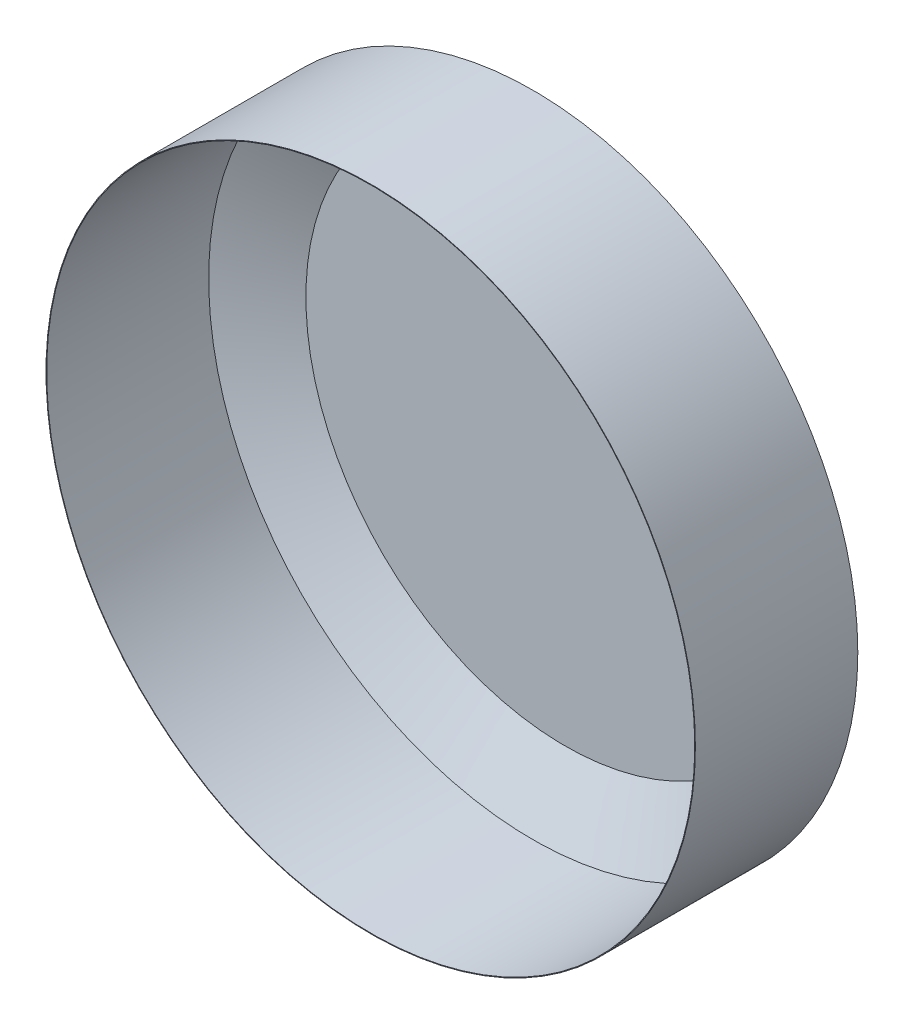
ISO-10303-21;
HEADER;
FILE_DESCRIPTION(('STEP AP214'),'2;1');
FILE_NAME('part.step','',(''),(''),'','','');
FILE_SCHEMA(('AUTOMOTIVE_DESIGN { 1 0 10303 214 1 1 1 1 }'));
ENDSEC;
DATA;
#1=APPLICATION_CONTEXT('core data for automotive mechanical design processes');
#2=APPLICATION_PROTOCOL_DEFINITION('international standard','automotive_design',2000,#1);
#3=PRODUCT_CONTEXT('',#1,'mechanical');
#4=PRODUCT('Part','Part','',(#3));
#5=PRODUCT_RELATED_PRODUCT_CATEGORY('part','',(#4));
#6=PRODUCT_DEFINITION_FORMATION('','',#4);
#7=PRODUCT_DEFINITION_CONTEXT('part definition',#1,'design');
#8=PRODUCT_DEFINITION('design','',#6,#7);
#9=PRODUCT_DEFINITION_SHAPE('','',#8);
#10=(LENGTH_UNIT() NAMED_UNIT(*) SI_UNIT(.MILLI.,.METRE.));
#11=(NAMED_UNIT(*) PLANE_ANGLE_UNIT() SI_UNIT($,.RADIAN.));
#12=(NAMED_UNIT(*) SI_UNIT($,.STERADIAN.) SOLID_ANGLE_UNIT());
#13=UNCERTAINTY_MEASURE_WITH_UNIT(LENGTH_MEASURE(1.E-05),#10,'distance_accuracy_value','');
#14=(GEOMETRIC_REPRESENTATION_CONTEXT(3) GLOBAL_UNCERTAINTY_ASSIGNED_CONTEXT((#13)) GLOBAL_UNIT_ASSIGNED_CONTEXT((#10,
#11,#12)) REPRESENTATION_CONTEXT('',''));
#15=CARTESIAN_POINT('',(0.,0.,0.));
#16=DIRECTION('',(0.,0.,1.));
#17=DIRECTION('',(1.,0.,0.));
#18=AXIS2_PLACEMENT_3D('',#15,#16,#17);
#19=CARTESIAN_POINT('',(-1200.,1200.,-300.));
#20=DIRECTION('',(0.,0.,-1.));
#21=DIRECTION('',(1.,0.,0.));
#22=AXIS2_PLACEMENT_3D('',#19,#20,#21);
#23=PLANE('',#22);
#24=CARTESIAN_POINT('',(0.,0.,-300.));
#25=DIRECTION('',(0.,0.,1.));
#26=DIRECTION('',(1.,0.,0.));
#27=AXIS2_PLACEMENT_3D('',#24,#25,#26);
#28=CIRCLE('',#27,400.);
#29=CARTESIAN_POINT('',(400.,0.,-300.));
#30=VERTEX_POINT('',#29);
#31=EDGE_CURVE('E18',#30,#30,#28,.T.);
#32=ORIENTED_EDGE('',*,*,#31,.T.);
#33=EDGE_LOOP('',(#32));
#34=FACE_BOUND('',#33,.T.);
#35=ADVANCED_FACE('F14',(#34),#23,.F.);
#36=CARTESIAN_POINT('',(0.,0.,-300.));
#37=DIRECTION('',(0.,0.,1.));
#38=DIRECTION('',(1.,0.,0.));
#39=AXIS2_PLACEMENT_3D('',#36,#37,#38);
#40=CONICAL_SURFACE('',#39,400.,1.10714871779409);
#41=CARTESIAN_POINT('',(0.,0.,-250.));
#42=DIRECTION('',(0.,0.,1.));
#43=DIRECTION('',(1.,0.,0.));
#44=AXIS2_PLACEMENT_3D('',#41,#42,#43);
#45=CIRCLE('',#44,500.);
#46=CARTESIAN_POINT('',(500.,0.,-250.));
#47=VERTEX_POINT('',#46);
#48=EDGE_CURVE('E30',#47,#47,#45,.T.);
#49=ORIENTED_EDGE('',*,*,#48,.T.);
#50=EDGE_LOOP('',(#49));
#51=FACE_BOUND('',#50,.T.);
#52=ORIENTED_EDGE('',*,*,#31,.F.);
#53=EDGE_LOOP('',(#52));
#54=FACE_BOUND('',#53,.T.);
#55=ADVANCED_FACE('F45',(#51,#54),#40,.F.);
#56=CARTESIAN_POINT('',(0.,0.,-250.));
#57=DIRECTION('',(0.,0.,1.));
#58=DIRECTION('',(1.,0.,0.));
#59=AXIS2_PLACEMENT_3D('',#56,#57,#58);
#60=CYLINDRICAL_SURFACE('',#59,500.);
#61=CARTESIAN_POINT('',(0.,0.,0.));
#62=DIRECTION('',(0.,0.,1.));
#63=DIRECTION('',(1.,0.,0.));
#64=AXIS2_PLACEMENT_3D('',#61,#62,#63);
#65=CIRCLE('',#64,500.);
#66=CARTESIAN_POINT('',(500.,0.,0.));
#67=VERTEX_POINT('',#66);
#68=EDGE_CURVE('E32',#67,#67,#65,.F.);
#69=ORIENTED_EDGE('',*,*,#68,.F.);
#70=EDGE_LOOP('',(#69));
#71=FACE_BOUND('',#70,.T.);
#72=ORIENTED_EDGE('',*,*,#48,.F.);
#73=EDGE_LOOP('',(#72));
#74=FACE_BOUND('',#73,.T.);
#75=ADVANCED_FACE('F41',(#71,#74),#60,.F.);
#76=CARTESIAN_POINT('',(-1200.,1200.,-301.));
#77=DIRECTION('',(0.,0.,-1.));
#78=DIRECTION('',(1.,0.,0.));
#79=AXIS2_PLACEMENT_3D('',#76,#77,#78);
#80=PLANE('',#79);
#81=CARTESIAN_POINT('',(1.11923040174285E-13,0.,-301.));
#82=DIRECTION('',(0.,0.,1.));
#83=DIRECTION('',(1.,0.,0.));
#84=AXIS2_PLACEMENT_3D('',#81,#82,#83);
#85=CIRCLE('',#84,400.2360679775);
#86=CARTESIAN_POINT('',(400.2360679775,0.,-301.));
#87=VERTEX_POINT('',#86);
#88=EDGE_CURVE('E27',#87,#87,#85,.T.);
#89=ORIENTED_EDGE('',*,*,#88,.F.);
#90=EDGE_LOOP('',(#89));
#91=FACE_BOUND('',#90,.T.);
#92=ADVANCED_FACE('F44',(#91),#80,.T.);
#93=CARTESIAN_POINT('',(-1000.,-866.02540378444,-1.6532731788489E-13));
#94=DIRECTION('',(0.,0.,1.));
#95=DIRECTION('',(1.,0.,0.));
#96=AXIS2_PLACEMENT_3D('',#93,#94,#95);
#97=PLANE('',#96);
#98=ORIENTED_EDGE('',*,*,#68,.T.);
#99=EDGE_LOOP('',(#98));
#100=FACE_BOUND('',#99,.T.);
#101=CARTESIAN_POINT('',(0.,0.,0.));
#102=DIRECTION('',(0.,0.,1.));
#103=DIRECTION('',(1.,0.,0.));
#104=AXIS2_PLACEMENT_3D('',#101,#102,#103);
#105=CIRCLE('',#104,501.);
#106=CARTESIAN_POINT('',(501.,0.,0.));
#107=VERTEX_POINT('',#106);
#108=EDGE_CURVE('E22',#107,#107,#105,.F.);
#109=ORIENTED_EDGE('',*,*,#108,.F.);
#110=EDGE_LOOP('',(#109));
#111=FACE_BOUND('',#110,.T.);
#112=ADVANCED_FACE('F38',(#100,#111),#97,.T.);
#113=CARTESIAN_POINT('',(1.11923040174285E-13,0.,-304.974427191));
#114=DIRECTION('',(0.,0.,1.));
#115=DIRECTION('',(1.,0.,0.));
#116=AXIS2_PLACEMENT_3D('',#113,#114,#115);
#117=CONICAL_SURFACE('',#116,392.2872135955,1.10714871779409);
#118=CARTESIAN_POINT('',(0.,0.,-250.61803398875));
#119=DIRECTION('',(0.,0.,1.));
#120=DIRECTION('',(1.,0.,0.));
#121=AXIS2_PLACEMENT_3D('',#118,#119,#120);
#122=CIRCLE('',#121,501.);
#123=CARTESIAN_POINT('',(501.,0.,-250.61803398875));
#124=VERTEX_POINT('',#123);
#125=EDGE_CURVE('E9',#124,#124,#122,.T.);
#126=ORIENTED_EDGE('',*,*,#125,.F.);
#127=EDGE_LOOP('',(#126));
#128=FACE_BOUND('',#127,.T.);
#129=ORIENTED_EDGE('',*,*,#88,.T.);
#130=EDGE_LOOP('',(#129));
#131=FACE_BOUND('',#130,.T.);
#132=ADVANCED_FACE('F61',(#128,#131),#117,.T.);
#133=CARTESIAN_POINT('',(0.,0.,-270.4));
#134=DIRECTION('',(0.,0.,1.));
#135=DIRECTION('',(1.,0.,0.));
#136=AXIS2_PLACEMENT_3D('',#133,#134,#135);
#137=CYLINDRICAL_SURFACE('',#136,501.);
#138=ORIENTED_EDGE('',*,*,#108,.T.);
#139=EDGE_LOOP('',(#138));
#140=FACE_BOUND('',#139,.T.);
#141=ORIENTED_EDGE('',*,*,#125,.T.);
#142=EDGE_LOOP('',(#141));
#143=FACE_BOUND('',#142,.T.);
#144=ADVANCED_FACE('F16',(#140,#143),#137,.T.);
#145=CLOSED_SHELL('',(#35,#55,#75,#92,#112,#132,#144));
#146=MANIFOLD_SOLID_BREP('B1',#145);
#147=ADVANCED_BREP_SHAPE_REPRESENTATION('',(#18,#146),#14);
#148=SHAPE_DEFINITION_REPRESENTATION(#9,#147);
ENDSEC;
END-ISO-10303-21;
